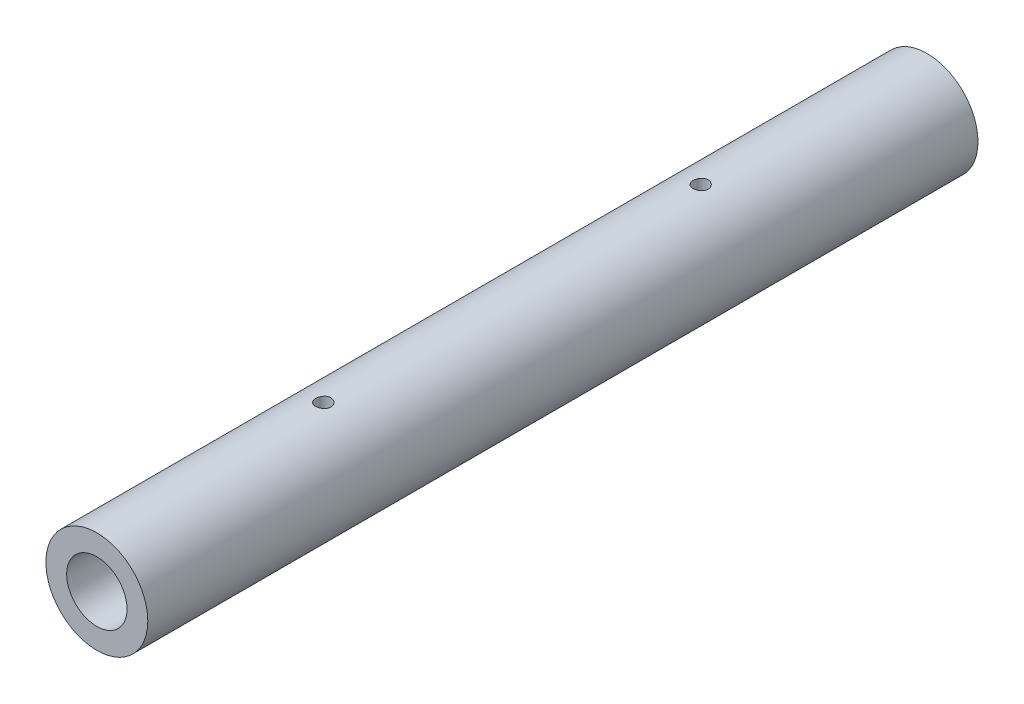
ISO-10303-21;
HEADER;
FILE_DESCRIPTION(('STEP AP214'),'2;1');
FILE_NAME('part.step','',(''),(''),'','','');
FILE_SCHEMA(('AUTOMOTIVE_DESIGN { 1 0 10303 214 1 1 1 1 }'));
ENDSEC;
DATA;
#1=APPLICATION_CONTEXT('core data for automotive mechanical design processes');
#2=APPLICATION_PROTOCOL_DEFINITION('international standard','automotive_design',2000,#1);
#3=PRODUCT_CONTEXT('',#1,'mechanical');
#4=PRODUCT('Part','Part','',(#3));
#5=PRODUCT_RELATED_PRODUCT_CATEGORY('part','',(#4));
#6=PRODUCT_DEFINITION_FORMATION('','',#4);
#7=PRODUCT_DEFINITION_CONTEXT('part definition',#1,'design');
#8=PRODUCT_DEFINITION('design','',#6,#7);
#9=PRODUCT_DEFINITION_SHAPE('','',#8);
#10=(LENGTH_UNIT() NAMED_UNIT(*) SI_UNIT(.MILLI.,.METRE.));
#11=(NAMED_UNIT(*) PLANE_ANGLE_UNIT() SI_UNIT($,.RADIAN.));
#12=(NAMED_UNIT(*) SI_UNIT($,.STERADIAN.) SOLID_ANGLE_UNIT());
#13=UNCERTAINTY_MEASURE_WITH_UNIT(LENGTH_MEASURE(1.E-05),#10,'distance_accuracy_value','');
#14=(GEOMETRIC_REPRESENTATION_CONTEXT(3) GLOBAL_UNCERTAINTY_ASSIGNED_CONTEXT((#13)) GLOBAL_UNIT_ASSIGNED_CONTEXT((#10,
#11,#12)) REPRESENTATION_CONTEXT('',''));
#15=CARTESIAN_POINT('',(0.,0.,0.));
#16=DIRECTION('',(0.,0.,1.));
#17=DIRECTION('',(1.,0.,0.));
#18=AXIS2_PLACEMENT_3D('',#15,#16,#17);
#19=CARTESIAN_POINT('',(0.,0.,-220.));
#20=DIRECTION('',(0.,0.,1.));
#21=DIRECTION('',(1.,0.,0.));
#22=AXIS2_PLACEMENT_3D('',#19,#20,#21);
#23=CYLINDRICAL_SURFACE('',#22,13.5);
#24=CARTESIAN_POINT('',(0.,0.,-220.));
#25=DIRECTION('',(0.,0.,1.));
#26=DIRECTION('',(1.,0.,0.));
#27=AXIS2_PLACEMENT_3D('',#24,#25,#26);
#28=CIRCLE('',#27,13.5);
#29=CARTESIAN_POINT('',(13.5,0.,-220.));
#30=VERTEX_POINT('',#29);
#31=EDGE_CURVE('E10',#30,#30,#28,.T.);
#32=ORIENTED_EDGE('',*,*,#31,.T.);
#33=EDGE_LOOP('',(#32));
#34=FACE_BOUND('',#33,.T.);
#35=CARTESIAN_POINT('',(0.,0.,0.));
#36=DIRECTION('',(0.,0.,1.));
#37=DIRECTION('',(1.,0.,0.));
#38=AXIS2_PLACEMENT_3D('',#35,#36,#37);
#39=CIRCLE('',#38,13.5);
#40=CARTESIAN_POINT('',(13.5,0.,0.));
#41=VERTEX_POINT('',#40);
#42=EDGE_CURVE('E43',#41,#41,#39,.T.);
#43=ORIENTED_EDGE('',*,*,#42,.F.);
#44=EDGE_LOOP('',(#43));
#45=FACE_BOUND('',#44,.T.);
#46=CARTESIAN_POINT('',(0.,13.5,-162.));
#47=CARTESIAN_POINT('',(0.111685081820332,13.4999982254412,-161.999995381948));
#48=CARTESIAN_POINT('',(0.223435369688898,13.4985995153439,-161.9906132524));
#49=CARTESIAN_POINT('',(0.443813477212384,13.4931543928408,-161.953341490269));
#50=CARTESIAN_POINT('',(0.552438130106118,13.4891053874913,-161.925433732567));
#51=CARTESIAN_POINT('',(0.763343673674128,13.4788147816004,-161.851961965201));
#52=CARTESIAN_POINT('',(0.865629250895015,13.4725748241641,-161.806411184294));
#53=CARTESIAN_POINT('',(1.06108906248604,13.4585921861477,-161.698978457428));
#54=CARTESIAN_POINT('',(1.15426458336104,13.4508497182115,-161.637098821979));
#55=CARTESIAN_POINT('',(1.32958603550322,13.4346572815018,-161.498261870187));
#56=CARTESIAN_POINT('',(1.41165241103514,13.4262028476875,-161.421204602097));
#57=CARTESIAN_POINT('',(1.56173971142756,13.4095743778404,-161.25441481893));
#58=CARTESIAN_POINT('',(1.62975983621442,13.401400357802,-161.164681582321));
#59=CARTESIAN_POINT('',(1.75013247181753,13.3862148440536,-160.974553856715));
#60=CARTESIAN_POINT('',(1.80240819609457,13.3792091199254,-160.87411025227));
#61=CARTESIAN_POINT('',(1.88931743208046,13.3672142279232,-160.665747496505));
#62=CARTESIAN_POINT('',(1.92395188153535,13.3622249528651,-160.557828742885));
#63=CARTESIAN_POINT('',(1.97434875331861,13.3548716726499,-160.33841499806));
#64=CARTESIAN_POINT('',(1.99024724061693,13.3524887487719,-160.226951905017));
#65=CARTESIAN_POINT('',(2.00314236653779,13.3505605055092,-160.002916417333));
#66=CARTESIAN_POINT('',(2.00014006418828,13.3510150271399,-159.890344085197));
#67=CARTESIAN_POINT('',(1.97543006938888,13.3546930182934,-159.668245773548));
#68=CARTESIAN_POINT('',(1.95387378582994,13.3578940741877,-159.558702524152));
#69=CARTESIAN_POINT('',(1.89290468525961,13.3666694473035,-159.344805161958));
#70=CARTESIAN_POINT('',(1.85349137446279,13.3722438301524,-159.240451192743));
#71=CARTESIAN_POINT('',(1.75776912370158,13.3851625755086,-159.039433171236));
#72=CARTESIAN_POINT('',(1.70139591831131,13.3925136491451,-158.942800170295));
#73=CARTESIAN_POINT('',(1.57339989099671,13.4081526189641,-158.760307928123));
#74=CARTESIAN_POINT('',(1.50177609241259,13.4164405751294,-158.674449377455));
#75=CARTESIAN_POINT('',(1.34448026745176,13.4331185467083,-158.515065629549));
#76=CARTESIAN_POINT('',(1.25867803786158,13.4415087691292,-158.441668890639));
#77=CARTESIAN_POINT('',(1.07590508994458,13.4573707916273,-158.310297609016));
#78=CARTESIAN_POINT('',(0.97893432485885,13.464842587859,-158.252323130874));
#79=CARTESIAN_POINT('',(0.776466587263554,13.4780334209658,-158.153435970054));
#80=CARTESIAN_POINT('',(0.670964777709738,13.4837514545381,-158.112533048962));
#81=CARTESIAN_POINT('',(0.454486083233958,13.4927820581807,-158.049060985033));
#82=CARTESIAN_POINT('',(0.343509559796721,13.4960947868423,-158.026490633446));
#83=CARTESIAN_POINT('',(0.120340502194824,13.4999205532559,-158.000494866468));
#84=CARTESIAN_POINT('',(0.00816896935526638,13.5004594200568,-157.996892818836));
#85=CARTESIAN_POINT('',(-0.21517651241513,13.4987470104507,-158.008467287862));
#86=CARTESIAN_POINT('',(-0.326350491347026,13.4964958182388,-158.023643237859));
#87=CARTESIAN_POINT('',(-0.544011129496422,13.4894722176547,-158.072196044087));
#88=CARTESIAN_POINT('',(-0.650517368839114,13.4847117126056,-158.105486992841));
#89=CARTESIAN_POINT('',(-0.856436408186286,13.473201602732,-158.189234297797));
#90=CARTESIAN_POINT('',(-0.955848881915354,13.4664519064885,-158.239691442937));
#91=CARTESIAN_POINT('',(-1.14553610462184,13.4516494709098,-158.356754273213));
#92=CARTESIAN_POINT('',(-1.23574088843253,13.4435878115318,-158.423472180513));
#93=CARTESIAN_POINT('',(-1.40373631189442,13.4270869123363,-158.571006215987));
#94=CARTESIAN_POINT('',(-1.48152624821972,13.4186476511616,-158.651823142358));
#95=CARTESIAN_POINT('',(-1.62312523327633,13.4022609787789,-158.826046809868));
#96=CARTESIAN_POINT('',(-1.68681598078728,13.3943181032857,-158.919550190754));
#97=CARTESIAN_POINT('',(-1.79758674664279,13.3799034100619,-159.116031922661));
#98=CARTESIAN_POINT('',(-1.84466720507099,13.373431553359,-159.219010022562));
#99=CARTESIAN_POINT('',(-1.92069694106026,13.3627243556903,-159.431162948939));
#100=CARTESIAN_POINT('',(-1.94970882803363,13.3584812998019,-159.540314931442));
#101=CARTESIAN_POINT('',(-1.98897735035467,13.3526914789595,-159.762009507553));
#102=CARTESIAN_POINT('',(-1.99923524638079,13.3511445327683,-159.874551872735));
#103=CARTESIAN_POINT('',(-2.00067515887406,13.3509287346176,-160.098653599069));
#104=CARTESIAN_POINT('',(-1.99204316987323,13.3522318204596,-160.210211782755));
#105=CARTESIAN_POINT('',(-1.95634654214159,13.3575083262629,-160.430271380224));
#106=CARTESIAN_POINT('',(-1.92928193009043,13.3614817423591,-160.538772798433));
#107=CARTESIAN_POINT('',(-1.8575534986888,13.3716414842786,-160.749589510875));
#108=CARTESIAN_POINT('',(-1.81290236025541,13.3778262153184,-160.851909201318));
#109=CARTESIAN_POINT('',(-1.707286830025,13.3917137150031,-161.047634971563));
#110=CARTESIAN_POINT('',(-1.64632191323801,13.3994165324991,-161.141040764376));
#111=CARTESIAN_POINT('',(-1.5091324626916,13.4155626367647,-161.317232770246));
#112=CARTESIAN_POINT('',(-1.43277009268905,13.4240121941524,-161.399911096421));
#113=CARTESIAN_POINT('',(-1.26724459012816,13.4406471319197,-161.551346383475));
#114=CARTESIAN_POINT('',(-1.17807848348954,13.4488324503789,-161.620100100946));
#115=CARTESIAN_POINT('',(-0.988914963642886,13.4640666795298,-161.742062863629));
#116=CARTESIAN_POINT('',(-0.888862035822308,13.471109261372,-161.795186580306));
#117=CARTESIAN_POINT('',(-0.681197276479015,13.483202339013,-161.883796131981));
#118=CARTESIAN_POINT('',(-0.573593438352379,13.4882549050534,-161.919300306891));
#119=CARTESIAN_POINT('',(-0.387917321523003,13.494640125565,-161.963572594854));
#120=CARTESIAN_POINT('',(-0.310993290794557,13.4966397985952,-161.977212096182));
#121=CARTESIAN_POINT('',(-0.156056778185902,13.4993203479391,-161.995427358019));
#122=CARTESIAN_POINT('',(-0.0780443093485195,13.5000012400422,-162.000003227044));
#123=CARTESIAN_POINT('',(0.,13.5,-162.));
#124=B_SPLINE_CURVE_WITH_KNOTS('',3,(#46,#47,#48,#49,#50,#51,#52,#53,#54,#55,#56,#57,#58,#59,
#60,#61,#62,#63,#64,#65,#66,#67,#68,#69,#70,#71,#72,#73,#74,#75,#76,#77,#78,#79,#80,#81,#82,#83,
#84,#85,#86,#87,#88,#89,#90,#91,#92,#93,#94,#95,#96,#97,#98,#99,#100,#101,#102,#103,#104,#105,
#106,#107,#108,#109,#110,#111,#112,#113,#114,#115,#116,#117,#118,#119,#120,#121,#122,#123),
.UNSPECIFIED.,.T.,.F.,(4,2,2,2,2,2,2,2,2,2,2,2,2,2,2,2,2,2,2,2,2,2,2,2,2,2,2,2,2,2,2,2,2,2,2,2,
2,2,4),(0.,0.334770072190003,0.669868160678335,1.0047154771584,1.33951543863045,
1.67659873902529,2.01370123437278,2.3524221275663,2.69112501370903,3.02735269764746,
3.36356154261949,3.69705250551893,4.0305526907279,4.36533286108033,4.70013447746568,
5.0382015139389,5.3762699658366,5.71453146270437,6.05277065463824,6.38785453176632,
6.72292829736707,7.05642670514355,7.38994044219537,7.72582452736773,8.06172763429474,
8.40035050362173,8.73896440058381,9.07639834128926,9.41380959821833,9.74791357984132,
10.0820170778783,10.4158801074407,10.7497538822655,11.0867609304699,11.4238463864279,
11.7627393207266,12.101278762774,12.3352152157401,12.5691488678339),.UNSPECIFIED.);
#125=CARTESIAN_POINT('',(0.,13.5,-162.));
#126=VERTEX_POINT('',#125);
#127=EDGE_CURVE('E59',#126,#126,#124,.T.);
#128=ORIENTED_EDGE('',*,*,#127,.T.);
#129=EDGE_LOOP('',(#128));
#130=FACE_BOUND('',#129,.T.);
#131=CARTESIAN_POINT('',(0.,13.5,-62.));
#132=CARTESIAN_POINT('',(0.111685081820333,13.4999982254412,-61.9999953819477));
#133=CARTESIAN_POINT('',(0.223435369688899,13.4985995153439,-61.9906132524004));
#134=CARTESIAN_POINT('',(0.443813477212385,13.4931543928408,-61.9533414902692));
#135=CARTESIAN_POINT('',(0.552438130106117,13.4891053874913,-61.9254337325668));
#136=CARTESIAN_POINT('',(0.763343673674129,13.4788147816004,-61.8519619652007));
#137=CARTESIAN_POINT('',(0.86562925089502,13.4725748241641,-61.8064111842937));
#138=CARTESIAN_POINT('',(1.06108906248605,13.4585921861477,-61.6989784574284));
#139=CARTESIAN_POINT('',(1.15426458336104,13.4508497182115,-61.6370988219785));
#140=CARTESIAN_POINT('',(1.32958603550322,13.4346572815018,-61.498261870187));
#141=CARTESIAN_POINT('',(1.41165241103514,13.4262028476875,-61.4212046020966));
#142=CARTESIAN_POINT('',(1.56173971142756,13.4095743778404,-61.2544148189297));
#143=CARTESIAN_POINT('',(1.62975983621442,13.401400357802,-61.1646815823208));
#144=CARTESIAN_POINT('',(1.75013247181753,13.3862148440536,-60.9745538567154));
#145=CARTESIAN_POINT('',(1.80240819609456,13.3792091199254,-60.8741102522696));
#146=CARTESIAN_POINT('',(1.88931743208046,13.3672142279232,-60.665747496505));
#147=CARTESIAN_POINT('',(1.92395188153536,13.3622249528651,-60.5578287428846));
#148=CARTESIAN_POINT('',(1.97434875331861,13.3548716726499,-60.3384149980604));
#149=CARTESIAN_POINT('',(1.99024724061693,13.3524887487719,-60.2269519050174));
#150=CARTESIAN_POINT('',(2.00314236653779,13.3505605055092,-60.0029164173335));
#151=CARTESIAN_POINT('',(2.00014006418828,13.3510150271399,-59.8903440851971));
#152=CARTESIAN_POINT('',(1.97543006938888,13.3546930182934,-59.668245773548));
#153=CARTESIAN_POINT('',(1.95387378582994,13.3578940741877,-59.5587025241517));
#154=CARTESIAN_POINT('',(1.89290468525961,13.3666694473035,-59.3448051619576));
#155=CARTESIAN_POINT('',(1.85349137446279,13.3722438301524,-59.2404511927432));
#156=CARTESIAN_POINT('',(1.75776912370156,13.3851625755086,-59.0394331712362));
#157=CARTESIAN_POINT('',(1.70139591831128,13.3925136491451,-58.9428001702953));
#158=CARTESIAN_POINT('',(1.57339989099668,13.4081526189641,-58.7603079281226));
#159=CARTESIAN_POINT('',(1.50177609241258,13.4164405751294,-58.6744493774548));
#160=CARTESIAN_POINT('',(1.34448026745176,13.4331185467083,-58.5150656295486));
#161=CARTESIAN_POINT('',(1.25867803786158,13.4415087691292,-58.4416688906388));
#162=CARTESIAN_POINT('',(1.07590508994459,13.4573707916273,-58.3102976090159));
#163=CARTESIAN_POINT('',(0.978934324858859,13.464842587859,-58.252323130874));
#164=CARTESIAN_POINT('',(0.776466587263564,13.4780334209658,-58.1534359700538));
#165=CARTESIAN_POINT('',(0.670964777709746,13.4837514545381,-58.1125330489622));
#166=CARTESIAN_POINT('',(0.454486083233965,13.4927820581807,-58.0490609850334));
#167=CARTESIAN_POINT('',(0.343509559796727,13.4960947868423,-58.0264906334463));
#168=CARTESIAN_POINT('',(0.120340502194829,13.4999205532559,-58.000494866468));
#169=CARTESIAN_POINT('',(0.00816896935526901,13.5004594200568,-57.9968928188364));
#170=CARTESIAN_POINT('',(-0.215176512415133,13.4987470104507,-58.0084672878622));
#171=CARTESIAN_POINT('',(-0.326350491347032,13.4964958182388,-58.0236432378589));
#172=CARTESIAN_POINT('',(-0.544011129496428,13.4894722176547,-58.0721960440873));
#173=CARTESIAN_POINT('',(-0.650517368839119,13.4847117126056,-58.1054869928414));
#174=CARTESIAN_POINT('',(-0.856436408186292,13.473201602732,-58.1892342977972));
#175=CARTESIAN_POINT('',(-0.955848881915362,13.4664519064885,-58.2396914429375));
#176=CARTESIAN_POINT('',(-1.14553610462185,13.4516494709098,-58.3567542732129));
#177=CARTESIAN_POINT('',(-1.23574088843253,13.4435878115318,-58.4234721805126));
#178=CARTESIAN_POINT('',(-1.40373631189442,13.4270869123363,-58.5710062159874));
#179=CARTESIAN_POINT('',(-1.48152624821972,13.4186476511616,-58.6518231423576));
#180=CARTESIAN_POINT('',(-1.62312523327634,13.4022609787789,-58.8260468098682));
#181=CARTESIAN_POINT('',(-1.68681598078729,13.3943181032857,-58.9195501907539));
#182=CARTESIAN_POINT('',(-1.7975867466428,13.3799034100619,-59.1160319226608));
#183=CARTESIAN_POINT('',(-1.84466720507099,13.373431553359,-59.2190100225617));
#184=CARTESIAN_POINT('',(-1.92069694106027,13.3627243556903,-59.4311629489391));
#185=CARTESIAN_POINT('',(-1.94970882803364,13.3584812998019,-59.5403149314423));
#186=CARTESIAN_POINT('',(-1.98897735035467,13.3526914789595,-59.7620095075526));
#187=CARTESIAN_POINT('',(-1.99923524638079,13.3511445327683,-59.8745518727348));
#188=CARTESIAN_POINT('',(-2.00067515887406,13.3509287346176,-60.0986535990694));
#189=CARTESIAN_POINT('',(-1.99204316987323,13.3522318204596,-60.2102117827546));
#190=CARTESIAN_POINT('',(-1.95634654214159,13.3575083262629,-60.4302713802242));
#191=CARTESIAN_POINT('',(-1.92928193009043,13.3614817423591,-60.5387727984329));
#192=CARTESIAN_POINT('',(-1.8575534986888,13.3716414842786,-60.7495895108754));
#193=CARTESIAN_POINT('',(-1.81290236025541,13.3778262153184,-60.8519092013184));
#194=CARTESIAN_POINT('',(-1.707286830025,13.3917137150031,-61.0476349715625));
#195=CARTESIAN_POINT('',(-1.64632191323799,13.3994165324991,-61.1410407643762));
#196=CARTESIAN_POINT('',(-1.50913246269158,13.4155626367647,-61.317232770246));
#197=CARTESIAN_POINT('',(-1.43277009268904,13.4240121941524,-61.3999110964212));
#198=CARTESIAN_POINT('',(-1.26724459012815,13.4406471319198,-61.551346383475));
#199=CARTESIAN_POINT('',(-1.17807848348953,13.4488324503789,-61.620100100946));
#200=CARTESIAN_POINT('',(-0.988914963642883,13.4640666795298,-61.7420628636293));
#201=CARTESIAN_POINT('',(-0.888862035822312,13.471109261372,-61.7951865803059));
#202=CARTESIAN_POINT('',(-0.681197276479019,13.483202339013,-61.8837961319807));
#203=CARTESIAN_POINT('',(-0.573593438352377,13.4882549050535,-61.9193003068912));
#204=CARTESIAN_POINT('',(-0.387917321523,13.494640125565,-61.9635725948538));
#205=CARTESIAN_POINT('',(-0.310993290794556,13.4966397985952,-61.9772120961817));
#206=CARTESIAN_POINT('',(-0.156056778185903,13.4993203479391,-61.9954273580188));
#207=CARTESIAN_POINT('',(-0.0780443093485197,13.5000012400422,-62.0000032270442));
#208=CARTESIAN_POINT('',(0.,13.5,-62.));
#209=B_SPLINE_CURVE_WITH_KNOTS('',3,(#131,#132,#133,#134,#135,#136,#137,#138,#139,#140,#141,
#142,#143,#144,#145,#146,#147,#148,#149,#150,#151,#152,#153,#154,#155,#156,#157,#158,#159,#160,
#161,#162,#163,#164,#165,#166,#167,#168,#169,#170,#171,#172,#173,#174,#175,#176,#177,#178,#179,
#180,#181,#182,#183,#184,#185,#186,#187,#188,#189,#190,#191,#192,#193,#194,#195,#196,#197,#198,
#199,#200,#201,#202,#203,#204,#205,#206,#207,#208),.UNSPECIFIED.,.T.,.F.,(4,2,2,2,2,2,2,2,2,2,2,
2,2,2,2,2,2,2,2,2,2,2,2,2,2,2,2,2,2,2,2,2,2,2,2,2,2,2,4),(0.,0.334770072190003,0.66986816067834,
1.0047154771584,1.33951543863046,1.67659873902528,2.01370123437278,2.35242212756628,
2.69112501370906,3.02735269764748,3.36356154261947,3.69705250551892,4.03055269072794,
4.36533286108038,4.7001344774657,5.0382015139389,5.37626996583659,5.71453146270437,
6.05277065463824,6.38785453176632,6.72292829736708,7.05642670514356,7.38994044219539,
7.72582452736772,8.06172763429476,8.40035050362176,8.73896440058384,9.0763983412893,
9.41380959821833,9.74791357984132,10.0820170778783,10.4158801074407,10.7497538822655,
11.08676093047,11.4238463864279,11.7627393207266,12.101278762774,12.3352152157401,
12.5691488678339),.UNSPECIFIED.);
#210=CARTESIAN_POINT('',(0.,13.5,-62.));
#211=VERTEX_POINT('',#210);
#212=EDGE_CURVE('E77',#211,#211,#209,.T.);
#213=ORIENTED_EDGE('',*,*,#212,.T.);
#214=EDGE_LOOP('',(#213));
#215=FACE_BOUND('',#214,.T.);
#216=ADVANCED_FACE('F30',(#34,#45,#130,#215),#23,.T.);
#217=CARTESIAN_POINT('',(0.,0.,-220.));
#218=DIRECTION('',(0.,0.,1.));
#219=DIRECTION('',(1.,0.,0.));
#220=AXIS2_PLACEMENT_3D('',#217,#218,#219);
#221=CYLINDRICAL_SURFACE('',#220,8.);
#222=CARTESIAN_POINT('',(0.,0.,-220.));
#223=DIRECTION('',(0.,0.,1.));
#224=DIRECTION('',(1.,0.,0.));
#225=AXIS2_PLACEMENT_3D('',#222,#223,#224);
#226=CIRCLE('',#225,8.);
#227=CARTESIAN_POINT('',(8.,0.,-220.));
#228=VERTEX_POINT('',#227);
#229=EDGE_CURVE('E48',#228,#228,#226,.T.);
#230=ORIENTED_EDGE('',*,*,#229,.F.);
#231=EDGE_LOOP('',(#230));
#232=FACE_BOUND('',#231,.T.);
#233=CARTESIAN_POINT('',(0.,0.,0.));
#234=DIRECTION('',(0.,0.,1.));
#235=DIRECTION('',(1.,0.,0.));
#236=AXIS2_PLACEMENT_3D('',#233,#234,#235);
#237=CIRCLE('',#236,8.);
#238=CARTESIAN_POINT('',(8.,0.,0.));
#239=VERTEX_POINT('',#238);
#240=EDGE_CURVE('E51',#239,#239,#237,.T.);
#241=ORIENTED_EDGE('',*,*,#240,.T.);
#242=EDGE_LOOP('',(#241));
#243=FACE_BOUND('',#242,.T.);
#244=CARTESIAN_POINT('',(0.,8.,-162.));
#245=CARTESIAN_POINT('',(0.110501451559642,7.9999981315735,-161.999996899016));
#246=CARTESIAN_POINT('',(0.22103754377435,7.99768770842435,-161.990811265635));
#247=CARTESIAN_POINT('',(0.438941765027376,7.98869485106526,-161.954366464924));
#248=CARTESIAN_POINT('',(0.546308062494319,7.98200993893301,-161.92709705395));
#249=CARTESIAN_POINT('',(0.754694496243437,7.96500835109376,-161.855414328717));
#250=CARTESIAN_POINT('',(0.855722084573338,7.95469603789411,-161.811021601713));
#251=CARTESIAN_POINT('',(1.04889617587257,7.93153791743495,-161.706424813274));
#252=CARTESIAN_POINT('',(1.14104237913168,7.91869202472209,-161.646220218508));
#253=CARTESIAN_POINT('',(1.31573590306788,7.89156551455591,-161.510398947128));
#254=CARTESIAN_POINT('',(1.39807425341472,7.87726276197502,-161.434517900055));
#255=CARTESIAN_POINT('',(1.54899856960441,7.84898160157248,-161.270063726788));
#256=CARTESIAN_POINT('',(1.61758298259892,7.83500323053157,-161.181489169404));
#257=CARTESIAN_POINT('',(1.74003539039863,7.80873034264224,-160.992539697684));
#258=CARTESIAN_POINT('',(1.79366962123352,7.79646392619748,-160.892009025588));
#259=CARTESIAN_POINT('',(1.88319587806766,7.77532659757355,-160.683002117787));
#260=CARTESIAN_POINT('',(1.91909074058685,7.76645514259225,-160.574527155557));
#261=CARTESIAN_POINT('',(1.97140644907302,7.7533396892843,-160.355008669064));
#262=CARTESIAN_POINT('',(1.98820302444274,7.74900654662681,-160.244060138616));
#263=CARTESIAN_POINT('',(2.00301570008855,7.74519149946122,-160.020841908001));
#264=CARTESIAN_POINT('',(2.00103485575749,7.74570880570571,-159.908572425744));
#265=CARTESIAN_POINT('',(1.97864869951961,7.75145607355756,-159.688778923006));
#266=CARTESIAN_POINT('',(1.95869112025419,7.75657150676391,-159.581205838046));
#267=CARTESIAN_POINT('',(1.901632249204,7.77075612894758,-159.370985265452));
#268=CARTESIAN_POINT('',(1.86452973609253,7.77982559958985,-159.268338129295));
#269=CARTESIAN_POINT('',(1.77385263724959,7.80100151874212,-159.069682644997));
#270=CARTESIAN_POINT('',(1.72011555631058,7.81313769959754,-158.973751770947));
#271=CARTESIAN_POINT('',(1.59780836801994,7.83906281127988,-158.792108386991));
#272=CARTESIAN_POINT('',(1.52923566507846,7.85285203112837,-158.706397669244));
#273=CARTESIAN_POINT('',(1.37688456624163,7.88101174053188,-158.545061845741));
#274=CARTESIAN_POINT('',(1.29272834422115,7.89538759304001,-158.469794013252));
#275=CARTESIAN_POINT('',(1.11281589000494,7.92274620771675,-158.334371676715));
#276=CARTESIAN_POINT('',(1.01705930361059,7.93572892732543,-158.274217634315));
#277=CARTESIAN_POINT('',(0.816154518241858,7.9589030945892,-158.170599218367));
#278=CARTESIAN_POINT('',(0.710975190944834,7.96908480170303,-158.127192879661));
#279=CARTESIAN_POINT('',(0.494501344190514,7.98543889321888,-158.058776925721));
#280=CARTESIAN_POINT('',(0.383207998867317,7.99161204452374,-158.033763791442));
#281=CARTESIAN_POINT('',(0.16071996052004,7.999139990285,-158.003389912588));
#282=CARTESIAN_POINT('',(0.0495956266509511,8.00061404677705,-157.9975426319));
#283=CARTESIAN_POINT('',(-0.172043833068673,7.99891739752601,-158.004332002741));
#284=CARTESIAN_POINT('',(-0.282559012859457,7.99574710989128,-158.016966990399));
#285=CARTESIAN_POINT('',(-0.498152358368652,7.98519441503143,-158.059961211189));
#286=CARTESIAN_POINT('',(-0.603286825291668,7.97787512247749,-158.090055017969));
#287=CARTESIAN_POINT('',(-0.807009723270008,7.95984942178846,-158.166809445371));
#288=CARTESIAN_POINT('',(-0.905597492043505,7.94914267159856,-158.213471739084));
#289=CARTESIAN_POINT('',(-1.09536417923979,7.92524410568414,-158.322981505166));
#290=CARTESIAN_POINT('',(-1.18638058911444,7.91201156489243,-158.386101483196));
#291=CARTESIAN_POINT('',(-1.35670215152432,7.88459345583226,-158.526386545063));
#292=CARTESIAN_POINT('',(-1.43600527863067,7.87040772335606,-158.603554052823));
#293=CARTESIAN_POINT('',(-1.58265409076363,7.84225275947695,-158.772002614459));
#294=CARTESIAN_POINT('',(-1.6496584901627,7.82829738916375,-158.863583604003));
#295=CARTESIAN_POINT('',(-1.76734767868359,7.80257171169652,-159.056976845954));
#296=CARTESIAN_POINT('',(-1.81803319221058,7.79080130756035,-159.158788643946));
#297=CARTESIAN_POINT('',(-1.90126856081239,7.77090792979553,-159.369207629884));
#298=CARTESIAN_POINT('',(-1.93392586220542,7.76276340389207,-159.477770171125));
#299=CARTESIAN_POINT('',(-1.98046087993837,7.75102325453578,-159.699079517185));
#300=CARTESIAN_POINT('',(-1.99434270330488,7.74742663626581,-159.811825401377));
#301=CARTESIAN_POINT('',(-2.00271812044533,7.74526534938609,-160.034828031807));
#302=CARTESIAN_POINT('',(-1.99775719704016,7.74655910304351,-160.145063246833));
#303=CARTESIAN_POINT('',(-1.96983637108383,7.7537054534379,-160.363071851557));
#304=CARTESIAN_POINT('',(-1.94687683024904,7.75955795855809,-160.470845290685));
#305=CARTESIAN_POINT('',(-1.88390842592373,7.77508347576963,-160.680277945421));
#306=CARTESIAN_POINT('',(-1.84400187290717,7.78473353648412,-160.78196974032));
#307=CARTESIAN_POINT('',(-1.74835321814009,7.80677007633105,-160.977287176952));
#308=CARTESIAN_POINT('',(-1.69260892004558,7.81915693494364,-161.070911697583));
#309=CARTESIAN_POINT('',(-1.56515699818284,7.8456751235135,-161.250072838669));
#310=CARTESIAN_POINT('',(-1.493070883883,7.85984353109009,-161.335334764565));
#311=CARTESIAN_POINT('',(-1.3357191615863,7.88810702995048,-161.492729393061));
#312=CARTESIAN_POINT('',(-1.25045042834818,7.90220210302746,-161.564858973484));
#313=CARTESIAN_POINT('',(-1.06729011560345,7.92903540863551,-161.695215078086));
#314=CARTESIAN_POINT('',(-0.969197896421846,7.94174444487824,-161.753166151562));
#315=CARTESIAN_POINT('',(-0.76435474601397,7.96406566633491,-161.851663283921));
#316=CARTESIAN_POINT('',(-0.65761008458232,7.97368006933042,-161.892221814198));
#317=CARTESIAN_POINT('',(-0.459213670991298,7.98730746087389,-161.94876244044));
#318=CARTESIAN_POINT('',(-0.368506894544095,7.99203446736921,-161.967934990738));
#319=CARTESIAN_POINT('',(-0.185208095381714,7.99838140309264,-161.993554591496));
#320=CARTESIAN_POINT('',(-0.0926162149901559,8.00000156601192,-162.000002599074));
#321=CARTESIAN_POINT('',(0.,8.,-162.));
#322=B_SPLINE_CURVE_WITH_KNOTS('',3,(#244,#245,#246,#247,#248,#249,#250,#251,#252,#253,#254,
#255,#256,#257,#258,#259,#260,#261,#262,#263,#264,#265,#266,#267,#268,#269,#270,#271,#272,#273,
#274,#275,#276,#277,#278,#279,#280,#281,#282,#283,#284,#285,#286,#287,#288,#289,#290,#291,#292,
#293,#294,#295,#296,#297,#298,#299,#300,#301,#302,#303,#304,#305,#306,#307,#308,#309,#310,#311,
#312,#313,#314,#315,#316,#317,#318,#319,#320,#321),.UNSPECIFIED.,.T.,.F.,(4,2,2,2,2,2,2,2,2,2,2,
2,2,2,2,2,2,2,2,2,2,2,2,2,2,2,2,2,2,2,2,2,2,2,2,2,2,2,4),(0.,0.33116494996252,0.662517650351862,
0.993473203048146,1.32443992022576,1.6615258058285,1.99864972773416,2.34078196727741,
2.68285948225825,3.01808393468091,3.35325384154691,3.68029996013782,4.00736937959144,
4.33774037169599,4.6681692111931,5.00802001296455,5.34788119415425,5.6889097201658,
6.02987298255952,6.36211078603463,6.69431868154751,7.02160366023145,7.34892169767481,
7.68204783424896,8.01523150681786,8.35659345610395,8.69794025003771,9.03723006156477,
9.37644564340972,9.70591707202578,10.0353818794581,10.3628853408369,10.6904342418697,
11.0265276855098,11.3627009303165,11.7049624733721,12.046978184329,12.3245632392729,
12.6021274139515),.UNSPECIFIED.);
#323=CARTESIAN_POINT('',(0.,8.,-162.));
#324=VERTEX_POINT('',#323);
#325=EDGE_CURVE('E53',#324,#324,#322,.T.);
#326=ORIENTED_EDGE('',*,*,#325,.F.);
#327=EDGE_LOOP('',(#326));
#328=FACE_BOUND('',#327,.T.);
#329=CARTESIAN_POINT('',(0.,8.,-62.));
#330=CARTESIAN_POINT('',(0.110501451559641,7.9999981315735,-61.9999968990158));
#331=CARTESIAN_POINT('',(0.22103754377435,7.99768770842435,-61.990811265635));
#332=CARTESIAN_POINT('',(0.438941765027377,7.98869485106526,-61.954366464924));
#333=CARTESIAN_POINT('',(0.54630806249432,7.98200993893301,-61.9270970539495));
#334=CARTESIAN_POINT('',(0.754694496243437,7.96500835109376,-61.8554143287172));
#335=CARTESIAN_POINT('',(0.855722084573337,7.95469603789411,-61.811021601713));
#336=CARTESIAN_POINT('',(1.04889617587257,7.93153791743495,-61.7064248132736));
#337=CARTESIAN_POINT('',(1.14104237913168,7.91869202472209,-61.646220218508));
#338=CARTESIAN_POINT('',(1.31573590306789,7.89156551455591,-61.5103989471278));
#339=CARTESIAN_POINT('',(1.39807425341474,7.87726276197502,-61.4345179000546));
#340=CARTESIAN_POINT('',(1.54899856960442,7.84898160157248,-61.270063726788));
#341=CARTESIAN_POINT('',(1.61758298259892,7.83500323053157,-61.1814891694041));
#342=CARTESIAN_POINT('',(1.74003539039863,7.80873034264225,-60.992539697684));
#343=CARTESIAN_POINT('',(1.79366962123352,7.79646392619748,-60.8920090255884));
#344=CARTESIAN_POINT('',(1.88319587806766,7.77532659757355,-60.6830021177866));
#345=CARTESIAN_POINT('',(1.91909074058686,7.76645514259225,-60.5745271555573));
#346=CARTESIAN_POINT('',(1.97140644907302,7.7533396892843,-60.3550086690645));
#347=CARTESIAN_POINT('',(1.98820302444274,7.74900654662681,-60.244060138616));
#348=CARTESIAN_POINT('',(2.00301570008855,7.74519149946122,-60.0208419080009));
#349=CARTESIAN_POINT('',(2.00103485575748,7.74570880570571,-59.9085724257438));
#350=CARTESIAN_POINT('',(1.97864869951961,7.75145607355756,-59.6887789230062));
#351=CARTESIAN_POINT('',(1.95869112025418,7.75657150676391,-59.5812058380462));
#352=CARTESIAN_POINT('',(1.90163224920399,7.77075612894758,-59.3709852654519));
#353=CARTESIAN_POINT('',(1.86452973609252,7.77982559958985,-59.2683381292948));
#354=CARTESIAN_POINT('',(1.77385263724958,7.80100151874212,-59.0696826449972));
#355=CARTESIAN_POINT('',(1.72011555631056,7.81313769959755,-58.9737517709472));
#356=CARTESIAN_POINT('',(1.59780836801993,7.83906281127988,-58.7921083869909));
#357=CARTESIAN_POINT('',(1.52923566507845,7.85285203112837,-58.7063976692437));
#358=CARTESIAN_POINT('',(1.37688456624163,7.88101174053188,-58.5450618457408));
#359=CARTESIAN_POINT('',(1.29272834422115,7.89538759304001,-58.4697940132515));
#360=CARTESIAN_POINT('',(1.11281589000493,7.92274620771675,-58.3343716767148));
#361=CARTESIAN_POINT('',(1.01705930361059,7.93572892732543,-58.2742176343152));
#362=CARTESIAN_POINT('',(0.816154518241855,7.95890309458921,-58.1705992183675));
#363=CARTESIAN_POINT('',(0.710975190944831,7.96908480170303,-58.1271928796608));
#364=CARTESIAN_POINT('',(0.49450134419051,7.98543889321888,-58.0587769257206));
#365=CARTESIAN_POINT('',(0.383207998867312,7.99161204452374,-58.0337637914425));
#366=CARTESIAN_POINT('',(0.160719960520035,7.999139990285,-58.0033899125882));
#367=CARTESIAN_POINT('',(0.0495956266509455,8.00061404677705,-57.9975426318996));
#368=CARTESIAN_POINT('',(-0.172043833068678,7.99891739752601,-58.0043320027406));
#369=CARTESIAN_POINT('',(-0.28255901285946,7.99574710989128,-58.0169669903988));
#370=CARTESIAN_POINT('',(-0.498152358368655,7.98519441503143,-58.0599612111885));
#371=CARTESIAN_POINT('',(-0.603286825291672,7.97787512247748,-58.0900550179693));
#372=CARTESIAN_POINT('',(-0.807009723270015,7.95984942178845,-58.1668094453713));
#373=CARTESIAN_POINT('',(-0.905597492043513,7.94914267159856,-58.2134717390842));
#374=CARTESIAN_POINT('',(-1.0953641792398,7.92524410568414,-58.3229815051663));
#375=CARTESIAN_POINT('',(-1.18638058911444,7.91201156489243,-58.3861014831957));
#376=CARTESIAN_POINT('',(-1.35670215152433,7.88459345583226,-58.5263865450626));
#377=CARTESIAN_POINT('',(-1.43600527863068,7.87040772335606,-58.6035540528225));
#378=CARTESIAN_POINT('',(-1.58265409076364,7.84225275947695,-58.7720026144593));
#379=CARTESIAN_POINT('',(-1.64965849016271,7.82829738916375,-58.8635836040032));
#380=CARTESIAN_POINT('',(-1.7673476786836,7.80257171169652,-59.0569768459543));
#381=CARTESIAN_POINT('',(-1.81803319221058,7.79080130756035,-59.1587886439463));
#382=CARTESIAN_POINT('',(-1.90126856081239,7.77090792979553,-59.3692076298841));
#383=CARTESIAN_POINT('',(-1.93392586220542,7.76276340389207,-59.4777701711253));
#384=CARTESIAN_POINT('',(-1.98046087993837,7.75102325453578,-59.6990795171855));
#385=CARTESIAN_POINT('',(-1.99434270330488,7.74742663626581,-59.8118254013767));
#386=CARTESIAN_POINT('',(-2.00271812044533,7.74526534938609,-60.0348280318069));
#387=CARTESIAN_POINT('',(-1.99775719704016,7.74655910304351,-60.145063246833));
#388=CARTESIAN_POINT('',(-1.96983637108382,7.7537054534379,-60.3630718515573));
#389=CARTESIAN_POINT('',(-1.94687683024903,7.75955795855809,-60.4708452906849));
#390=CARTESIAN_POINT('',(-1.88390842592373,7.77508347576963,-60.6802779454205));
#391=CARTESIAN_POINT('',(-1.84400187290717,7.78473353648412,-60.7819697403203));
#392=CARTESIAN_POINT('',(-1.7483532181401,7.80677007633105,-60.9772871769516));
#393=CARTESIAN_POINT('',(-1.69260892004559,7.81915693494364,-61.0709116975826));
#394=CARTESIAN_POINT('',(-1.56515699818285,7.84567512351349,-61.2500728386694));
#395=CARTESIAN_POINT('',(-1.49307088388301,7.85984353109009,-61.3353347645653));
#396=CARTESIAN_POINT('',(-1.33571916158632,7.88810702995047,-61.4927293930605));
#397=CARTESIAN_POINT('',(-1.2504504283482,7.90220210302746,-61.564858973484));
#398=CARTESIAN_POINT('',(-1.06729011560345,7.9290354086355,-61.6952150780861));
#399=CARTESIAN_POINT('',(-0.96919789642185,7.94174444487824,-61.7531661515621));
#400=CARTESIAN_POINT('',(-0.764354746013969,7.96406566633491,-61.8516632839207));
#401=CARTESIAN_POINT('',(-0.657610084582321,7.97368006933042,-61.8922218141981));
#402=CARTESIAN_POINT('',(-0.459213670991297,7.98730746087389,-61.9487624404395));
#403=CARTESIAN_POINT('',(-0.368506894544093,7.9920344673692,-61.9679349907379));
#404=CARTESIAN_POINT('',(-0.185208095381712,7.99838140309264,-61.9935545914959));
#405=CARTESIAN_POINT('',(-0.0926162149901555,8.00000156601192,-62.0000025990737));
#406=CARTESIAN_POINT('',(0.,8.,-62.));
#407=B_SPLINE_CURVE_WITH_KNOTS('',3,(#329,#330,#331,#332,#333,#334,#335,#336,#337,#338,#339,
#340,#341,#342,#343,#344,#345,#346,#347,#348,#349,#350,#351,#352,#353,#354,#355,#356,#357,#358,
#359,#360,#361,#362,#363,#364,#365,#366,#367,#368,#369,#370,#371,#372,#373,#374,#375,#376,#377,
#378,#379,#380,#381,#382,#383,#384,#385,#386,#387,#388,#389,#390,#391,#392,#393,#394,#395,#396,
#397,#398,#399,#400,#401,#402,#403,#404,#405,#406),.UNSPECIFIED.,.T.,.F.,(4,2,2,2,2,2,2,2,2,2,2,
2,2,2,2,2,2,2,2,2,2,2,2,2,2,2,2,2,2,2,2,2,2,2,2,2,2,2,4),(0.,0.331164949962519,
0.662517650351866,0.993473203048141,1.32443992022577,1.66152580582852,1.99864972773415,
2.34078196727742,2.68285948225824,3.01808393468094,3.35325384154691,3.68029996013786,
4.00736937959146,4.337740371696,4.66816921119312,5.00802001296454,5.34788119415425,
5.6889097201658,6.02987298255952,6.36211078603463,6.69431868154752,7.02160366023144,
7.34892169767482,7.68204783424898,8.01523150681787,8.35659345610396,8.69794025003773,
9.03723006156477,9.37644564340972,9.70591707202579,10.0353818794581,10.3628853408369,
10.6904342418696,11.0265276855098,11.3627009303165,11.7049624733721,12.046978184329,
12.3245632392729,12.6021274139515),.UNSPECIFIED.);
#408=CARTESIAN_POINT('',(0.,8.,-62.));
#409=VERTEX_POINT('',#408);
#410=EDGE_CURVE('E34',#409,#409,#407,.T.);
#411=ORIENTED_EDGE('',*,*,#410,.F.);
#412=EDGE_LOOP('',(#411));
#413=FACE_BOUND('',#412,.T.);
#414=ADVANCED_FACE('F60',(#232,#243,#328,#413),#221,.F.);
#415=CARTESIAN_POINT('',(0.,0.,-220.));
#416=DIRECTION('',(0.,0.,1.));
#417=DIRECTION('',(1.,0.,0.));
#418=AXIS2_PLACEMENT_3D('',#415,#416,#417);
#419=PLANE('',#418);
#420=ORIENTED_EDGE('',*,*,#229,.T.);
#421=EDGE_LOOP('',(#420));
#422=FACE_BOUND('',#421,.T.);
#423=ORIENTED_EDGE('',*,*,#31,.F.);
#424=EDGE_LOOP('',(#423));
#425=FACE_BOUND('',#424,.T.);
#426=ADVANCED_FACE('F92',(#422,#425),#419,.F.);
#427=CARTESIAN_POINT('',(0.,0.,0.));
#428=DIRECTION('',(0.,0.,1.));
#429=DIRECTION('',(1.,0.,0.));
#430=AXIS2_PLACEMENT_3D('',#427,#428,#429);
#431=PLANE('',#430);
#432=ORIENTED_EDGE('',*,*,#240,.F.);
#433=EDGE_LOOP('',(#432));
#434=FACE_BOUND('',#433,.T.);
#435=ORIENTED_EDGE('',*,*,#42,.T.);
#436=EDGE_LOOP('',(#435));
#437=FACE_BOUND('',#436,.T.);
#438=ADVANCED_FACE('F67',(#434,#437),#431,.T.);
#439=CARTESIAN_POINT('',(0.,13.5,-160.));
#440=DIRECTION('',(0.,-1.,0.));
#441=DIRECTION('',(0.,0.,-1.));
#442=AXIS2_PLACEMENT_3D('',#439,#440,#441);
#443=CYLINDRICAL_SURFACE('',#442,2.);
#444=ORIENTED_EDGE('',*,*,#127,.F.);
#445=EDGE_LOOP('',(#444));
#446=FACE_BOUND('',#445,.T.);
#447=ORIENTED_EDGE('',*,*,#325,.T.);
#448=EDGE_LOOP('',(#447));
#449=FACE_BOUND('',#448,.T.);
#450=ADVANCED_FACE('F63',(#446,#449),#443,.F.);
#451=CARTESIAN_POINT('',(0.,13.5,-60.));
#452=DIRECTION('',(0.,-1.,0.));
#453=DIRECTION('',(0.,0.,-1.));
#454=AXIS2_PLACEMENT_3D('',#451,#452,#453);
#455=CYLINDRICAL_SURFACE('',#454,2.);
#456=ORIENTED_EDGE('',*,*,#212,.F.);
#457=EDGE_LOOP('',(#456));
#458=FACE_BOUND('',#457,.T.);
#459=ORIENTED_EDGE('',*,*,#410,.T.);
#460=EDGE_LOOP('',(#459));
#461=FACE_BOUND('',#460,.T.);
#462=ADVANCED_FACE('F66',(#458,#461),#455,.F.);
#463=CLOSED_SHELL('',(#216,#414,#426,#438,#450,#462));
#464=MANIFOLD_SOLID_BREP('B2',#463);
#465=ADVANCED_BREP_SHAPE_REPRESENTATION('',(#18,#464),#14);
#466=SHAPE_DEFINITION_REPRESENTATION(#9,#465);
ENDSEC;
END-ISO-10303-21;
